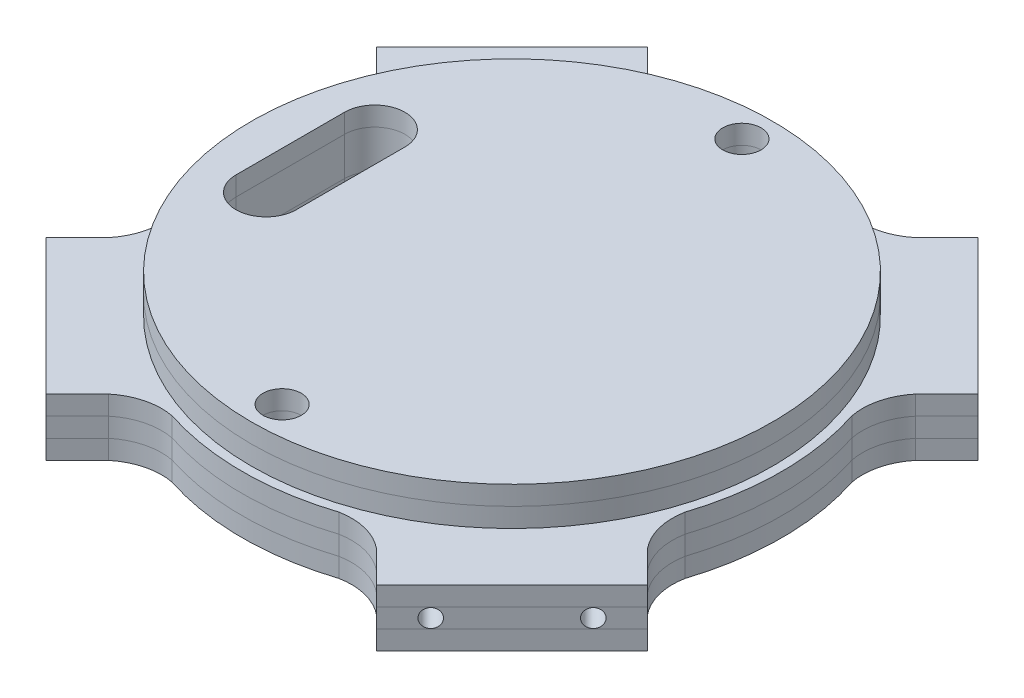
from build123d import *

# Parameters (mm, degrees)
SKETCH1_R           = 43.18
BOSS_EXTRUDE1_DEPTH = 3.175
SKETCH11_R          = 43.18
BOSS_EXTRUDE5_DEPTH = 3.175
SKETCH2_R           = 57.15
BOSS_EXTRUDE2_DEPTH = 3.175
SKETCH9_R           = 57.15
BOSS_EXTRUDE3_DEPTH = 3.175
SKETCH10_R          = 57.15
BOSS_EXTRUDE4_DEPTH = 3.175
SKETCH5_R           = 3.175
CUT_EXTRUDE2_DEPTH  = 82.814026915
SKETCH6_W           = 31.75
SKETCH6_H           = 9.525
CUT_EXTRUDE3_DEPTH  = 2.54
CIRPATTERN1_COUNT   = 4
SKETCH12_R          = 1.5
CUT_EXTRUDE5_DEPTH  = 12
CUT_EXTRUDE7_DEPTH  = 82.381635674
CIRPATTERN25_COUNT  = 4
CUT_EXTRUDE8_DEPTH  = 73.250611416


with BuildPart() as part:
    # Sketch1 → Boss-Extrude1 (new body)
    with BuildSketch(Plane(origin=(0, 0, 0), x_dir=(1, 0, 0), z_dir=(0, 1, 0))):
        with Locations(Location((0, 0, 0), (0, 0, 270))):
            Circle(SKETCH1_R)
    extrude(amount=BOSS_EXTRUDE1_DEPTH)

    # Sketch2 → Boss-Extrude2 (add)
    with BuildSketch(Plane(origin=(0, 0, 0), x_dir=(1, 0, 0), z_dir=(0, 1, 0))):
        with Locations(Location((0, 0, 0), (0, 0, 270))):
            Circle(SKETCH2_R)
    extrude(amount=-BOSS_EXTRUDE2_DEPTH)


with BuildPart() as body_2:
    # Sketch11 → Boss-Extrude5 (new body)
    with BuildSketch(Plane(origin=(0, 3.175, 0), x_dir=(1, 0, 0), z_dir=(0, 1, 0))):
        with Locations(Location((0, 0, 0), (0, 0, 270))):
            Circle(SKETCH11_R)
    extrude(amount=BOSS_EXTRUDE5_DEPTH)


with BuildPart() as body_3:
    # Sketch9 → Boss-Extrude3 (new body)
    with BuildSketch(Plane.XZ.offset(3.175)):
        with Locations(Location((0, 0, 0), (0, 0, 270))):
            Circle(SKETCH9_R)
    extrude(amount=BOSS_EXTRUDE3_DEPTH)


with BuildPart() as body_4:
    # Sketch10 → Boss-Extrude4 (new body)
    with BuildSketch(Plane(origin=(0, -6.35, 0), x_dir=(-1, 0, 0), z_dir=(0, -1, 0))):
        with Locations(Location((0, 0, 0), (0, 0, 90))):
            Circle(SKETCH10_R)
    extrude(amount=BOSS_EXTRUDE4_DEPTH)


with BuildPart() as cut_extrude2_tool:
    # Sketch5 → Cut-Extrude2 (new, symmetric)
    with BuildSketch(Plane(origin=(0, 3.175, 0), x_dir=(1, 0, 0), z_dir=(0, 1, 0))):
        with Locations(Location((0, 38.1, 0), (0, 0, 270))):
            Circle(SKETCH5_R)
    cut_extrude2 = extrude(amount=CUT_EXTRUDE2_DEPTH, both=True)


with BuildPart() as part_1:
    add(part.part)

    # Cut-Extrude2: cut by cut_extrude2_tool
    add(cut_extrude2_tool.part, mode=Mode.SUBTRACT)


with BuildPart() as body_2_1:
    add(body_2.part)

    # Cut-Extrude2: cut by cut_extrude2_tool
    add(cut_extrude2_tool.part, mode=Mode.SUBTRACT)


with BuildPart() as body_3_1:
    add(body_3.part)

    # Cut-Extrude2: cut by cut_extrude2_tool
    add(cut_extrude2_tool.part, mode=Mode.SUBTRACT)


with BuildPart() as body_4_1:
    add(body_4.part)

    # Cut-Extrude2: cut by cut_extrude2_tool
    add(cut_extrude2_tool.part, mode=Mode.SUBTRACT)


with BuildPart() as mirror1_tool:
    # Mirror1: Cut-Extrude2 across plane
    add(cut_extrude2.mirror(Plane.XY))


with BuildPart() as part_2:
    add(part_1.part)

    # Mirror1: cut by mirror1_tool
    add(mirror1_tool.part, mode=Mode.SUBTRACT)


with BuildPart() as body_2_2:
    add(body_2_1.part)

    # Mirror1: cut by mirror1_tool
    add(mirror1_tool.part, mode=Mode.SUBTRACT)


with BuildPart() as body_3_2:
    add(body_3_1.part)

    # Mirror1: cut by mirror1_tool
    add(mirror1_tool.part, mode=Mode.SUBTRACT)


with BuildPart() as body_4_2:
    add(body_4_1.part)

    # Mirror1: cut by mirror1_tool
    add(mirror1_tool.part, mode=Mode.SUBTRACT)


with BuildPart() as cut_extrude3_tool:
    # Sketch6 → Cut-Extrude3 (new body)
    with BuildSketch(Plane(origin=(-40.411152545, 0, -40.411152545), x_dir=(-0.7071067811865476, 0, 0.7071067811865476), z_dir=(-0.7071067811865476, 0, -0.7071067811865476))):
        with Locations((0, -4.7625)):
            Rectangle(SKETCH6_W, SKETCH6_H)
    cut_extrude3 = extrude(amount=-CUT_EXTRUDE3_DEPTH)


with BuildPart() as part_3:
    add(part_2.part)

    # Cut-Extrude3: cut by cut_extrude3_tool
    add(cut_extrude3_tool.part, mode=Mode.SUBTRACT)


with BuildPart() as body_3_3:
    add(body_3_2.part)

    # Cut-Extrude3: cut by cut_extrude3_tool
    add(cut_extrude3_tool.part, mode=Mode.SUBTRACT)


with BuildPart() as body_4_3:
    add(body_4_2.part)

    # Cut-Extrude3: cut by cut_extrude3_tool
    add(cut_extrude3_tool.part, mode=Mode.SUBTRACT)


with BuildPart() as cirpattern1_tool:
    # CirPattern1: Cut-Extrude3 ×4 about axis
    cirpattern1_axis = Axis((0, 0, 0), (0, 1, 0))
    for i in range(1, CIRPATTERN1_COUNT):
        add(cut_extrude3.rotate(cirpattern1_axis, i * 360 / CIRPATTERN1_COUNT))


with BuildPart() as part_4:
    add(part_3.part)

    # CirPattern1: cut by cirpattern1_tool
    add(cirpattern1_tool.part, mode=Mode.SUBTRACT)


with BuildPart() as body_3_4:
    add(body_3_3.part)

    # CirPattern1: cut by cirpattern1_tool
    add(cirpattern1_tool.part, mode=Mode.SUBTRACT)

    # Sketch12 → Cut-Extrude5 (cut)
    with BuildSketch(Plane(origin=(-38.615101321, 0, -38.615101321), x_dir=(-0.7071067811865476, 0, 0.7071067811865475), z_dir=(-0.7071067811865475, 0, -0.7071067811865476))):
        with Locations((9.525, -4.7625)):
            Circle(SKETCH12_R)
        with Locations((-9.525, -4.7625)):
            Circle(SKETCH12_R)
    cut_extrude5 = extrude(amount=-CUT_EXTRUDE5_DEPTH, mode=Mode.SUBTRACT)


with BuildPart() as body_4_4:
    add(body_4_3.part)

    # CirPattern1: cut by cirpattern1_tool
    add(cirpattern1_tool.part, mode=Mode.SUBTRACT)


with BuildPart() as cut_extrude7_tool:
    # Sketch14 → Cut-Extrude7 (new, through all)
    with BuildSketch(Plane(origin=(0, 0, 0), x_dir=(1, 0, 0), z_dir=(0, 1, 0))):
        with BuildLine():
            Line((50.046106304, -27.595466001), (44.657952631, -22.207312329))
            ThreePointArc((44.657952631, -22.207312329), (42.647740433, -18.25050363), (42.516030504, -13.814295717))
            ThreePointArc((42.516030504, -13.814295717), (44.704, 0), (42.516030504, 13.814295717))
            ThreePointArc((42.516030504, 13.814295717), (42.647740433, 18.25050363), (44.657952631, 22.207312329))
            Line((44.657952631, 22.207312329), (50.046106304, 27.595466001))
            ThreePointArc((50.046106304, 27.595466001), (57.15, 0), (50.046106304, -27.595466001))
        make_face()
        with BuildLine():
            Line((-27.595466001, -50.046106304), (-22.207312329, -44.657952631))
            ThreePointArc((-22.207312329, -44.657952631), (-18.25050363, -42.647740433), (-13.814295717, -42.516030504))
            ThreePointArc((-13.814295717, -42.516030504), (0, -44.704), (13.814295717, -42.516030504))
            ThreePointArc((13.814295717, -42.516030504), (18.25050363, -42.647740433), (22.207312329, -44.657952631))
            Line((22.207312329, -44.657952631), (27.595466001, -50.046106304))
            ThreePointArc((27.595466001, -50.046106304), (0, -57.15), (-27.595466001, -50.046106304))
        make_face()
        with BuildLine():
            Line((-50.046106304, 27.595466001), (-44.657952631, 22.207312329))
            ThreePointArc((-44.657952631, 22.207312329), (-42.647740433, 18.25050363), (-42.516030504, 13.814295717))
            ThreePointArc((-42.516030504, 13.814295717), (-44.704, 0), (-42.516030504, -13.814295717))
            ThreePointArc((-42.516030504, -13.814295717), (-42.647740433, -18.25050363), (-44.657952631, -22.207312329))
            Line((-44.657952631, -22.207312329), (-50.046106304, -27.595466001))
            ThreePointArc((-50.046106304, -27.595466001), (-57.15, 0), (-50.046106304, 27.595466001))
        make_face()
        with BuildLine():
            Line((27.595466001, 50.046106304), (22.207312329, 44.657952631))
            ThreePointArc((22.207312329, 44.657952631), (18.25050363, 42.647740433), (13.814295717, 42.516030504))
            ThreePointArc((13.814295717, 42.516030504), (0, 44.704), (-13.814295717, 42.516030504))
            ThreePointArc((-13.814295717, 42.516030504), (-18.25050363, 42.647740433), (-22.207312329, 44.657952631))
            Line((-22.207312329, 44.657952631), (-27.595466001, 50.046106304))
            ThreePointArc((-27.595466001, 50.046106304), (0, 57.15), (27.595466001, 50.046106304))
        make_face()
    extrude(amount=-CUT_EXTRUDE7_DEPTH)


with BuildPart() as part_5:
    add(part_4.part)

    # Cut-Extrude7: cut by cut_extrude7_tool
    add(cut_extrude7_tool.part, mode=Mode.SUBTRACT)


with BuildPart() as body_3_5:
    add(body_3_4.part)

    # Cut-Extrude7: cut by cut_extrude7_tool
    add(cut_extrude7_tool.part, mode=Mode.SUBTRACT)

    # CirPattern25: Cut-Extrude5 ×4 about axis
    cirpattern25_axis = Axis((0, 0, 0), (0, 1, 0))
    for i in range(1, CIRPATTERN25_COUNT):
        add(cut_extrude5.rotate(cirpattern25_axis, i * 360 / CIRPATTERN25_COUNT), mode=Mode.SUBTRACT)


with BuildPart() as body_4_5:
    add(body_4_4.part)

    # Cut-Extrude7: cut by cut_extrude7_tool
    add(cut_extrude7_tool.part, mode=Mode.SUBTRACT)


with BuildPart() as cut_extrude8_tool:
    # Sketch15 → Cut-Extrude8 (new, through all)
    with BuildSketch(Plane(origin=(0, -9.525, 0), x_dir=(-1, 0, 0), z_dir=(0, -1, 0))):
        with BuildLine():
            Line((36.75, 9), (36.75, -9))
            ThreePointArc((36.75, -9), (31.75, -14), (26.75, -9))
            Line((26.75, -9), (26.75, 9))
            ThreePointArc((26.75, 9), (31.75, 14), (36.75, 9))
        make_face()
    extrude(amount=-CUT_EXTRUDE8_DEPTH)


with BuildPart() as part_6:
    add(part_5.part)

    # Cut-Extrude8: cut by cut_extrude8_tool
    add(cut_extrude8_tool.part, mode=Mode.SUBTRACT)


with BuildPart() as body_2_3:
    add(body_2_2.part)

    # Cut-Extrude8: cut by cut_extrude8_tool
    add(cut_extrude8_tool.part, mode=Mode.SUBTRACT)


with BuildPart() as body_3_6:
    add(body_3_5.part)

    # Cut-Extrude8: cut by cut_extrude8_tool
    add(cut_extrude8_tool.part, mode=Mode.SUBTRACT)


with BuildPart() as body_4_6:
    add(body_4_5.part)

    # Cut-Extrude8: cut by cut_extrude8_tool
    add(cut_extrude8_tool.part, mode=Mode.SUBTRACT)


solid = Compound([part_6.part, body_2_3.part, body_3_6.part, body_4_6.part])
